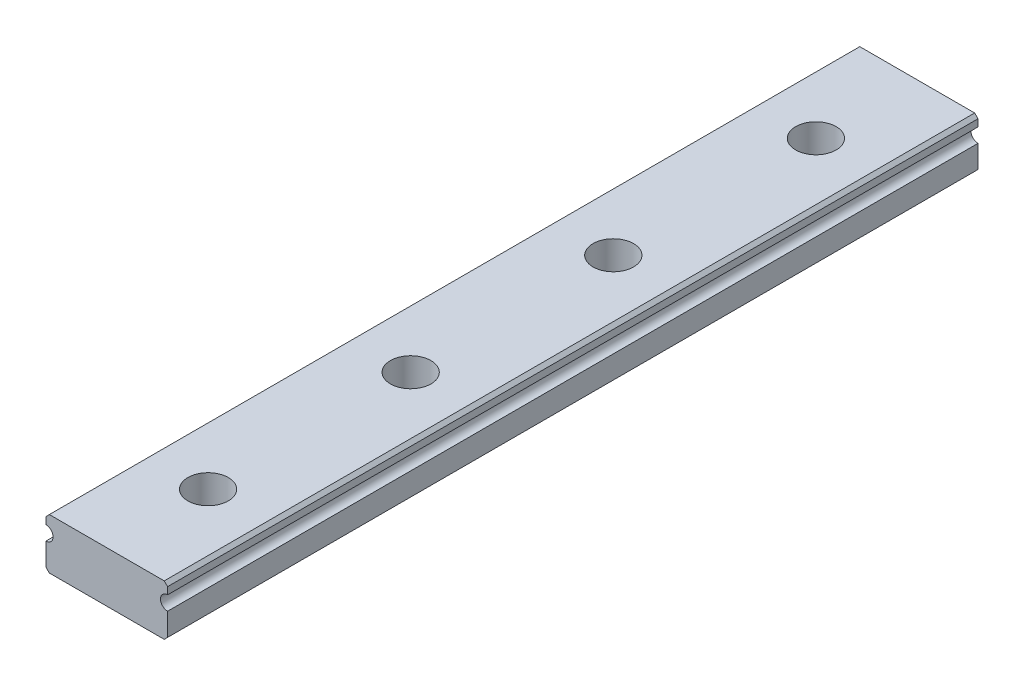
ISO-10303-21;
HEADER;
FILE_DESCRIPTION(('STEP AP214'),'2;1');
FILE_NAME('part.step','',(''),(''),'','','');
FILE_SCHEMA(('AUTOMOTIVE_DESIGN { 1 0 10303 214 1 1 1 1 }'));
ENDSEC;
DATA;
#1=APPLICATION_CONTEXT('core data for automotive mechanical design processes');
#2=APPLICATION_PROTOCOL_DEFINITION('international standard','automotive_design',2000,#1);
#3=PRODUCT_CONTEXT('',#1,'mechanical');
#4=PRODUCT('Part','Part','',(#3));
#5=PRODUCT_RELATED_PRODUCT_CATEGORY('part','',(#4));
#6=PRODUCT_DEFINITION_FORMATION('','',#4);
#7=PRODUCT_DEFINITION_CONTEXT('part definition',#1,'design');
#8=PRODUCT_DEFINITION('design','',#6,#7);
#9=PRODUCT_DEFINITION_SHAPE('','',#8);
#10=(LENGTH_UNIT() NAMED_UNIT(*) SI_UNIT(.MILLI.,.METRE.));
#11=(NAMED_UNIT(*) PLANE_ANGLE_UNIT() SI_UNIT($,.RADIAN.));
#12=(NAMED_UNIT(*) SI_UNIT($,.STERADIAN.) SOLID_ANGLE_UNIT());
#13=UNCERTAINTY_MEASURE_WITH_UNIT(LENGTH_MEASURE(1.E-05),#10,'distance_accuracy_value','');
#14=(GEOMETRIC_REPRESENTATION_CONTEXT(3) GLOBAL_UNCERTAINTY_ASSIGNED_CONTEXT((#13)) GLOBAL_UNIT_ASSIGNED_CONTEXT((#10,
#11,#12)) REPRESENTATION_CONTEXT('',''));
#15=CARTESIAN_POINT('',(0.,0.,0.));
#16=DIRECTION('',(0.,0.,1.));
#17=DIRECTION('',(1.,0.,0.));
#18=AXIS2_PLACEMENT_3D('',#15,#16,#17);
#19=CARTESIAN_POINT('',(9.,5.956,80.));
#20=DIRECTION('',(-1.,0.,0.));
#21=DIRECTION('',(0.,0.,1.));
#22=AXIS2_PLACEMENT_3D('',#19,#20,#21);
#23=PLANE('',#22);
#24=DIRECTION('',(0.,1.,0.));
#25=VECTOR('',#24,1.);
#26=CARTESIAN_POINT('',(9.,5.956,-5.));
#27=LINE('',#26,#25);
#28=CARTESIAN_POINT('',(9.,7.00502525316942,-5.));
#29=VERTEX_POINT('',#28);
#30=CARTESIAN_POINT('',(9.,5.956,-5.));
#31=VERTEX_POINT('',#30);
#32=EDGE_CURVE('E207',#29,#31,#27,.F.);
#33=ORIENTED_EDGE('',*,*,#32,.F.);
#34=DIRECTION('',(0.,0.,1.));
#35=VECTOR('',#34,1.);
#36=CARTESIAN_POINT('',(9.,7.00502525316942,80.));
#37=LINE('',#36,#35);
#38=CARTESIAN_POINT('',(9.,7.00502525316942,115.));
#39=VERTEX_POINT('',#38);
#40=EDGE_CURVE('E232',#29,#39,#37,.T.);
#41=ORIENTED_EDGE('',*,*,#40,.T.);
#42=DIRECTION('',(0.,1.,0.));
#43=VECTOR('',#42,1.);
#44=CARTESIAN_POINT('',(9.,5.956,115.));
#45=LINE('',#44,#43);
#46=CARTESIAN_POINT('',(9.,5.956,115.));
#47=VERTEX_POINT('',#46);
#48=EDGE_CURVE('E210',#47,#39,#45,.T.);
#49=ORIENTED_EDGE('',*,*,#48,.F.);
#50=DIRECTION('',(0.,0.,-1.));
#51=VECTOR('',#50,1.);
#52=CARTESIAN_POINT('',(9.,5.956,80.));
#53=LINE('',#52,#51);
#54=EDGE_CURVE('E163',#47,#31,#53,.T.);
#55=ORIENTED_EDGE('',*,*,#54,.T.);
#56=EDGE_LOOP('',(#33,#41,#49,#55));
#57=FACE_BOUND('',#56,.T.);
#58=ADVANCED_FACE('F17',(#57),#23,.F.);
#59=CARTESIAN_POINT('',(-9.,7.00502525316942,80.));
#60=DIRECTION('',(1.,0.,0.));
#61=DIRECTION('',(0.,0.,-1.));
#62=AXIS2_PLACEMENT_3D('',#59,#60,#61);
#63=PLANE('',#62);
#64=DIRECTION('',(0.,1.,0.));
#65=VECTOR('',#64,1.);
#66=CARTESIAN_POINT('',(-9.,7.00502525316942,-5.));
#67=LINE('',#66,#65);
#68=CARTESIAN_POINT('',(-9.,5.956,-5.));
#69=VERTEX_POINT('',#68);
#70=CARTESIAN_POINT('',(-9.,7.00502525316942,-5.));
#71=VERTEX_POINT('',#70);
#72=EDGE_CURVE('E201',#69,#71,#67,.T.);
#73=ORIENTED_EDGE('',*,*,#72,.F.);
#74=DIRECTION('',(0.,0.,-1.));
#75=VECTOR('',#74,1.);
#76=CARTESIAN_POINT('',(-9.,5.956,80.));
#77=LINE('',#76,#75);
#78=CARTESIAN_POINT('',(-9.,5.956,115.));
#79=VERTEX_POINT('',#78);
#80=EDGE_CURVE('E149',#69,#79,#77,.F.);
#81=ORIENTED_EDGE('',*,*,#80,.T.);
#82=DIRECTION('',(0.,1.,0.));
#83=VECTOR('',#82,1.);
#84=CARTESIAN_POINT('',(-9.,7.00502525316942,115.));
#85=LINE('',#84,#83);
#86=CARTESIAN_POINT('',(-9.,7.00502525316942,115.));
#87=VERTEX_POINT('',#86);
#88=EDGE_CURVE('E104',#87,#79,#85,.F.);
#89=ORIENTED_EDGE('',*,*,#88,.F.);
#90=DIRECTION('',(0.,0.,1.));
#91=VECTOR('',#90,1.);
#92=CARTESIAN_POINT('',(-9.,7.00502525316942,80.));
#93=LINE('',#92,#91);
#94=EDGE_CURVE('E222',#87,#71,#93,.F.);
#95=ORIENTED_EDGE('',*,*,#94,.T.);
#96=EDGE_LOOP('',(#73,#81,#89,#95));
#97=FACE_BOUND('',#96,.T.);
#98=ADVANCED_FACE('F291',(#97),#63,.F.);
#99=CARTESIAN_POINT('',(0.,0.,40.));
#100=DIRECTION('',(0.,1.,0.));
#101=DIRECTION('',(0.,0.,1.));
#102=AXIS2_PLACEMENT_3D('',#99,#100,#101);
#103=CYLINDRICAL_SURFACE('',#102,3.);
#104=CARTESIAN_POINT('',(0.,3.,40.));
#105=DIRECTION('',(0.,1.,0.));
#106=DIRECTION('',(0.,0.,1.));
#107=AXIS2_PLACEMENT_3D('',#104,#105,#106);
#108=CIRCLE('',#107,3.);
#109=CARTESIAN_POINT('',(0.,3.,43.));
#110=VERTEX_POINT('',#109);
#111=EDGE_CURVE('E20',#110,#110,#108,.T.);
#112=ORIENTED_EDGE('',*,*,#111,.F.);
#113=EDGE_LOOP('',(#112));
#114=FACE_BOUND('',#113,.T.);
#115=CARTESIAN_POINT('',(0.,7.5,40.));
#116=DIRECTION('',(0.,1.,0.));
#117=DIRECTION('',(0.,0.,1.));
#118=AXIS2_PLACEMENT_3D('',#115,#116,#117);
#119=CIRCLE('',#118,3.);
#120=CARTESIAN_POINT('',(0.,7.5,43.));
#121=VERTEX_POINT('',#120);
#122=EDGE_CURVE('E150',#121,#121,#119,.T.);
#123=ORIENTED_EDGE('',*,*,#122,.T.);
#124=EDGE_LOOP('',(#123));
#125=FACE_BOUND('',#124,.T.);
#126=ADVANCED_FACE('F287',(#114,#125),#103,.F.);
#127=CARTESIAN_POINT('',(0.,0.,10.));
#128=DIRECTION('',(0.,1.,0.));
#129=DIRECTION('',(0.,0.,1.));
#130=AXIS2_PLACEMENT_3D('',#127,#128,#129);
#131=CYLINDRICAL_SURFACE('',#130,3.);
#132=CARTESIAN_POINT('',(0.,3.,10.));
#133=DIRECTION('',(0.,1.,0.));
#134=DIRECTION('',(0.,0.,1.));
#135=AXIS2_PLACEMENT_3D('',#132,#133,#134);
#136=CIRCLE('',#135,3.);
#137=CARTESIAN_POINT('',(0.,3.,13.));
#138=VERTEX_POINT('',#137);
#139=EDGE_CURVE('E179',#138,#138,#136,.T.);
#140=ORIENTED_EDGE('',*,*,#139,.F.);
#141=EDGE_LOOP('',(#140));
#142=FACE_BOUND('',#141,.T.);
#143=CARTESIAN_POINT('',(0.,7.5,10.));
#144=DIRECTION('',(0.,1.,0.));
#145=DIRECTION('',(0.,0.,1.));
#146=AXIS2_PLACEMENT_3D('',#143,#144,#145);
#147=CIRCLE('',#146,3.);
#148=CARTESIAN_POINT('',(0.,7.5,13.));
#149=VERTEX_POINT('',#148);
#150=EDGE_CURVE('E148',#149,#149,#147,.T.);
#151=ORIENTED_EDGE('',*,*,#150,.T.);
#152=EDGE_LOOP('',(#151));
#153=FACE_BOUND('',#152,.T.);
#154=ADVANCED_FACE('F290',(#142,#153),#131,.F.);
#155=CARTESIAN_POINT('',(-8.50502525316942,7.5,80.));
#156=DIRECTION('',(0.707106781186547,-0.707106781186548,0.));
#157=DIRECTION('',(0.707106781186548,0.707106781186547,0.));
#158=AXIS2_PLACEMENT_3D('',#155,#156,#157);
#159=PLANE('',#158);
#160=DIRECTION('',(0.707106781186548,0.707106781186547,0.));
#161=VECTOR('',#160,1.);
#162=CARTESIAN_POINT('',(-8.50502525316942,7.5,-5.));
#163=LINE('',#162,#161);
#164=CARTESIAN_POINT('',(-8.50502525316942,7.5,-5.));
#165=VERTEX_POINT('',#164);
#166=EDGE_CURVE('E219',#71,#165,#163,.T.);
#167=ORIENTED_EDGE('',*,*,#166,.F.);
#168=ORIENTED_EDGE('',*,*,#94,.F.);
#169=DIRECTION('',(0.707106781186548,0.707106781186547,0.));
#170=VECTOR('',#169,1.);
#171=CARTESIAN_POINT('',(-8.50502525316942,7.5,115.));
#172=LINE('',#171,#170);
#173=CARTESIAN_POINT('',(-8.50502525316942,7.5,115.));
#174=VERTEX_POINT('',#173);
#175=EDGE_CURVE('E203',#174,#87,#172,.F.);
#176=ORIENTED_EDGE('',*,*,#175,.F.);
#177=DIRECTION('',(0.,0.,-1.));
#178=VECTOR('',#177,1.);
#179=CARTESIAN_POINT('',(-8.50502525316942,7.5,80.));
#180=LINE('',#179,#178);
#181=EDGE_CURVE('E145',#174,#165,#180,.T.);
#182=ORIENTED_EDGE('',*,*,#181,.T.);
#183=EDGE_LOOP('',(#167,#168,#176,#182));
#184=FACE_BOUND('',#183,.T.);
#185=ADVANCED_FACE('F372',(#184),#159,.F.);
#186=CARTESIAN_POINT('',(9.,7.00502525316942,80.));
#187=DIRECTION('',(-0.707106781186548,-0.707106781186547,0.));
#188=DIRECTION('',(0.707106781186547,-0.707106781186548,0.));
#189=AXIS2_PLACEMENT_3D('',#186,#187,#188);
#190=PLANE('',#189);
#191=DIRECTION('',(0.707106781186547,-0.707106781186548,0.));
#192=VECTOR('',#191,1.);
#193=CARTESIAN_POINT('',(9.,7.00502525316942,-5.));
#194=LINE('',#193,#192);
#195=CARTESIAN_POINT('',(8.50502525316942,7.5,-5.));
#196=VERTEX_POINT('',#195);
#197=EDGE_CURVE('E235',#196,#29,#194,.T.);
#198=ORIENTED_EDGE('',*,*,#197,.F.);
#199=DIRECTION('',(0.,0.,-1.));
#200=VECTOR('',#199,1.);
#201=CARTESIAN_POINT('',(8.50502525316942,7.5,80.));
#202=LINE('',#201,#200);
#203=CARTESIAN_POINT('',(8.50502525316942,7.5,115.));
#204=VERTEX_POINT('',#203);
#205=EDGE_CURVE('E141',#196,#204,#202,.F.);
#206=ORIENTED_EDGE('',*,*,#205,.T.);
#207=DIRECTION('',(0.707106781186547,-0.707106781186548,0.));
#208=VECTOR('',#207,1.);
#209=CARTESIAN_POINT('',(9.,7.00502525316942,115.));
#210=LINE('',#209,#208);
#211=EDGE_CURVE('E221',#39,#204,#210,.F.);
#212=ORIENTED_EDGE('',*,*,#211,.F.);
#213=ORIENTED_EDGE('',*,*,#40,.F.);
#214=EDGE_LOOP('',(#198,#206,#212,#213));
#215=FACE_BOUND('',#214,.T.);
#216=ADVANCED_FACE('F363',(#215),#190,.F.);
#217=CARTESIAN_POINT('',(0.,0.,70.));
#218=DIRECTION('',(0.,1.,0.));
#219=DIRECTION('',(0.,0.,1.));
#220=AXIS2_PLACEMENT_3D('',#217,#218,#219);
#221=CYLINDRICAL_SURFACE('',#220,3.);
#222=CARTESIAN_POINT('',(0.,7.5,70.));
#223=DIRECTION('',(0.,1.,0.));
#224=DIRECTION('',(0.,0.,1.));
#225=AXIS2_PLACEMENT_3D('',#222,#223,#224);
#226=CIRCLE('',#225,3.);
#227=CARTESIAN_POINT('',(0.,7.5,73.));
#228=VERTEX_POINT('',#227);
#229=EDGE_CURVE('E144',#228,#228,#226,.T.);
#230=ORIENTED_EDGE('',*,*,#229,.T.);
#231=EDGE_LOOP('',(#230));
#232=FACE_BOUND('',#231,.T.);
#233=CARTESIAN_POINT('',(0.,3.,70.));
#234=DIRECTION('',(0.,1.,0.));
#235=DIRECTION('',(0.,0.,1.));
#236=AXIS2_PLACEMENT_3D('',#233,#234,#235);
#237=CIRCLE('',#236,3.);
#238=CARTESIAN_POINT('',(0.,3.,73.));
#239=VERTEX_POINT('',#238);
#240=EDGE_CURVE('E125',#239,#239,#237,.T.);
#241=ORIENTED_EDGE('',*,*,#240,.F.);
#242=EDGE_LOOP('',(#241));
#243=FACE_BOUND('',#242,.T.);
#244=ADVANCED_FACE('F360',(#232,#243),#221,.F.);
#245=CARTESIAN_POINT('',(0.,0.,100.));
#246=DIRECTION('',(0.,1.,0.));
#247=DIRECTION('',(0.,0.,1.));
#248=AXIS2_PLACEMENT_3D('',#245,#246,#247);
#249=CYLINDRICAL_SURFACE('',#248,3.);
#250=CARTESIAN_POINT('',(0.,7.5,100.));
#251=DIRECTION('',(0.,1.,0.));
#252=DIRECTION('',(0.,0.,1.));
#253=AXIS2_PLACEMENT_3D('',#250,#251,#252);
#254=CIRCLE('',#253,3.);
#255=CARTESIAN_POINT('',(0.,7.5,103.));
#256=VERTEX_POINT('',#255);
#257=EDGE_CURVE('E126',#256,#256,#254,.T.);
#258=ORIENTED_EDGE('',*,*,#257,.T.);
#259=EDGE_LOOP('',(#258));
#260=FACE_BOUND('',#259,.T.);
#261=CARTESIAN_POINT('',(0.,3.,100.));
#262=DIRECTION('',(0.,1.,0.));
#263=DIRECTION('',(0.,0.,1.));
#264=AXIS2_PLACEMENT_3D('',#261,#262,#263);
#265=CIRCLE('',#264,3.);
#266=CARTESIAN_POINT('',(0.,3.,103.));
#267=VERTEX_POINT('',#266);
#268=EDGE_CURVE('E267',#267,#267,#265,.T.);
#269=ORIENTED_EDGE('',*,*,#268,.F.);
#270=EDGE_LOOP('',(#269));
#271=FACE_BOUND('',#270,.T.);
#272=ADVANCED_FACE('F362',(#260,#271),#249,.F.);
#273=CARTESIAN_POINT('',(0.,3.,37.));
#274=DIRECTION('',(0.,1.,0.));
#275=DIRECTION('',(0.,0.,1.));
#276=AXIS2_PLACEMENT_3D('',#273,#274,#275);
#277=PLANE('',#276);
#278=CARTESIAN_POINT('',(0.,3.,40.));
#279=DIRECTION('',(0.,1.,0.));
#280=DIRECTION('',(0.,0.,1.));
#281=AXIS2_PLACEMENT_3D('',#278,#279,#280);
#282=CIRCLE('',#281,1.75);
#283=CARTESIAN_POINT('',(0.,3.,41.75));
#284=VERTEX_POINT('',#283);
#285=EDGE_CURVE('E264',#284,#284,#282,.F.);
#286=ORIENTED_EDGE('',*,*,#285,.T.);
#287=EDGE_LOOP('',(#286));
#288=FACE_BOUND('',#287,.T.);
#289=ORIENTED_EDGE('',*,*,#111,.T.);
#290=EDGE_LOOP('',(#289));
#291=FACE_BOUND('',#290,.T.);
#292=ADVANCED_FACE('F285',(#288,#291),#277,.T.);
#293=CARTESIAN_POINT('',(0.,3.,7.));
#294=DIRECTION('',(0.,1.,0.));
#295=DIRECTION('',(0.,0.,1.));
#296=AXIS2_PLACEMENT_3D('',#293,#294,#295);
#297=PLANE('',#296);
#298=CARTESIAN_POINT('',(0.,3.,10.));
#299=DIRECTION('',(0.,1.,0.));
#300=DIRECTION('',(0.,0.,1.));
#301=AXIS2_PLACEMENT_3D('',#298,#299,#300);
#302=CIRCLE('',#301,1.75);
#303=CARTESIAN_POINT('',(0.,3.,11.75));
#304=VERTEX_POINT('',#303);
#305=EDGE_CURVE('E116',#304,#304,#302,.F.);
#306=ORIENTED_EDGE('',*,*,#305,.T.);
#307=EDGE_LOOP('',(#306));
#308=FACE_BOUND('',#307,.T.);
#309=ORIENTED_EDGE('',*,*,#139,.T.);
#310=EDGE_LOOP('',(#309));
#311=FACE_BOUND('',#310,.T.);
#312=ADVANCED_FACE('F429',(#308,#311),#297,.T.);
#313=CARTESIAN_POINT('',(9.,4.906,80.));
#314=DIRECTION('',(0.,0.,-1.));
#315=DIRECTION('',(-1.,0.,0.));
#316=AXIS2_PLACEMENT_3D('',#313,#314,#315);
#317=CYLINDRICAL_SURFACE('',#316,1.05);
#318=CARTESIAN_POINT('',(9.,4.906,115.));
#319=DIRECTION('',(0.,0.,-1.));
#320=DIRECTION('',(-1.,0.,0.));
#321=AXIS2_PLACEMENT_3D('',#318,#319,#320);
#322=CIRCLE('',#321,1.05);
#323=CARTESIAN_POINT('',(9.,3.856,115.));
#324=VERTEX_POINT('',#323);
#325=EDGE_CURVE('E134',#324,#47,#322,.T.);
#326=ORIENTED_EDGE('',*,*,#325,.F.);
#327=DIRECTION('',(0.,0.,1.));
#328=VECTOR('',#327,1.);
#329=CARTESIAN_POINT('',(9.,3.856,80.));
#330=LINE('',#329,#328);
#331=CARTESIAN_POINT('',(9.,3.856,-5.));
#332=VERTEX_POINT('',#331);
#333=EDGE_CURVE('E151',#324,#332,#330,.F.);
#334=ORIENTED_EDGE('',*,*,#333,.T.);
#335=CARTESIAN_POINT('',(9.,4.906,-5.));
#336=DIRECTION('',(0.,0.,-1.));
#337=DIRECTION('',(-1.,0.,0.));
#338=AXIS2_PLACEMENT_3D('',#335,#336,#337);
#339=CIRCLE('',#338,1.05);
#340=EDGE_CURVE('E167',#31,#332,#339,.F.);
#341=ORIENTED_EDGE('',*,*,#340,.F.);
#342=ORIENTED_EDGE('',*,*,#54,.F.);
#343=EDGE_LOOP('',(#326,#334,#341,#342));
#344=FACE_BOUND('',#343,.T.);
#345=ADVANCED_FACE('F411',(#344),#317,.F.);
#346=CARTESIAN_POINT('',(9.,0.494974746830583,80.));
#347=DIRECTION('',(-1.,0.,0.));
#348=DIRECTION('',(0.,0.,1.));
#349=AXIS2_PLACEMENT_3D('',#346,#347,#348);
#350=PLANE('',#349);
#351=DIRECTION('',(0.,1.,0.));
#352=VECTOR('',#351,1.);
#353=CARTESIAN_POINT('',(9.,4.906,-5.));
#354=LINE('',#353,#352);
#355=CARTESIAN_POINT('',(9.,0.494974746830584,-5.00000000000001));
#356=VERTEX_POINT('',#355);
#357=EDGE_CURVE('E174',#332,#356,#354,.F.);
#358=ORIENTED_EDGE('',*,*,#357,.F.);
#359=ORIENTED_EDGE('',*,*,#333,.F.);
#360=DIRECTION('',(0.,1.,0.));
#361=VECTOR('',#360,1.);
#362=CARTESIAN_POINT('',(9.,4.906,115.));
#363=LINE('',#362,#361);
#364=CARTESIAN_POINT('',(9.,0.494974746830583,115.));
#365=VERTEX_POINT('',#364);
#366=EDGE_CURVE('E131',#365,#324,#363,.T.);
#367=ORIENTED_EDGE('',*,*,#366,.F.);
#368=DIRECTION('',(0.,0.,1.));
#369=VECTOR('',#368,1.);
#370=CARTESIAN_POINT('',(9.,0.494974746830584,80.));
#371=LINE('',#370,#369);
#372=EDGE_CURVE('E164',#365,#356,#371,.F.);
#373=ORIENTED_EDGE('',*,*,#372,.T.);
#374=EDGE_LOOP('',(#358,#359,#367,#373));
#375=FACE_BOUND('',#374,.T.);
#376=ADVANCED_FACE('F306',(#375),#350,.F.);
#377=CARTESIAN_POINT('',(-9.,4.906,80.));
#378=DIRECTION('',(0.,0.,-1.));
#379=DIRECTION('',(-1.,0.,0.));
#380=AXIS2_PLACEMENT_3D('',#377,#378,#379);
#381=CYLINDRICAL_SURFACE('',#380,1.05);
#382=CARTESIAN_POINT('',(-9.,4.906,-5.));
#383=DIRECTION('',(0.,0.,-1.));
#384=DIRECTION('',(-1.,0.,0.));
#385=AXIS2_PLACEMENT_3D('',#382,#383,#384);
#386=CIRCLE('',#385,1.05);
#387=CARTESIAN_POINT('',(-9.,3.856,-5.));
#388=VERTEX_POINT('',#387);
#389=EDGE_CURVE('E122',#388,#69,#386,.F.);
#390=ORIENTED_EDGE('',*,*,#389,.F.);
#391=DIRECTION('',(0.,0.,-1.));
#392=VECTOR('',#391,1.);
#393=CARTESIAN_POINT('',(-9.,3.856,80.));
#394=LINE('',#393,#392);
#395=CARTESIAN_POINT('',(-9.,3.856,115.));
#396=VERTEX_POINT('',#395);
#397=EDGE_CURVE('E119',#388,#396,#394,.F.);
#398=ORIENTED_EDGE('',*,*,#397,.T.);
#399=CARTESIAN_POINT('',(-9.,4.906,115.));
#400=DIRECTION('',(0.,0.,-1.));
#401=DIRECTION('',(-1.,0.,0.));
#402=AXIS2_PLACEMENT_3D('',#399,#400,#401);
#403=CIRCLE('',#402,1.05);
#404=EDGE_CURVE('E107',#79,#396,#403,.T.);
#405=ORIENTED_EDGE('',*,*,#404,.F.);
#406=ORIENTED_EDGE('',*,*,#80,.F.);
#407=EDGE_LOOP('',(#390,#398,#405,#406));
#408=FACE_BOUND('',#407,.T.);
#409=ADVANCED_FACE('F120',(#408),#381,.F.);
#410=CARTESIAN_POINT('',(8.50502525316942,7.5,80.));
#411=DIRECTION('',(0.,-1.,0.));
#412=DIRECTION('',(0.,0.,-1.));
#413=AXIS2_PLACEMENT_3D('',#410,#411,#412);
#414=PLANE('',#413);
#415=ORIENTED_EDGE('',*,*,#257,.F.);
#416=EDGE_LOOP('',(#415));
#417=FACE_BOUND('',#416,.T.);
#418=ORIENTED_EDGE('',*,*,#229,.F.);
#419=EDGE_LOOP('',(#418));
#420=FACE_BOUND('',#419,.T.);
#421=DIRECTION('',(-1.,0.,0.));
#422=VECTOR('',#421,1.);
#423=CARTESIAN_POINT('',(9.,7.5,-5.));
#424=LINE('',#423,#422);
#425=EDGE_CURVE('E198',#165,#196,#424,.F.);
#426=ORIENTED_EDGE('',*,*,#425,.F.);
#427=ORIENTED_EDGE('',*,*,#181,.F.);
#428=DIRECTION('',(1.,0.,0.));
#429=VECTOR('',#428,1.);
#430=CARTESIAN_POINT('',(-9.,7.5,115.));
#431=LINE('',#430,#429);
#432=EDGE_CURVE('E182',#204,#174,#431,.F.);
#433=ORIENTED_EDGE('',*,*,#432,.F.);
#434=ORIENTED_EDGE('',*,*,#205,.F.);
#435=EDGE_LOOP('',(#426,#427,#433,#434));
#436=FACE_BOUND('',#435,.T.);
#437=ORIENTED_EDGE('',*,*,#150,.F.);
#438=EDGE_LOOP('',(#437));
#439=FACE_BOUND('',#438,.T.);
#440=ORIENTED_EDGE('',*,*,#122,.F.);
#441=EDGE_LOOP('',(#440));
#442=FACE_BOUND('',#441,.T.);
#443=ADVANCED_FACE('F295',(#417,#420,#436,#439,#442),#414,.F.);
#444=CARTESIAN_POINT('',(-9.,3.856,80.));
#445=DIRECTION('',(1.,0.,0.));
#446=DIRECTION('',(0.,0.,-1.));
#447=AXIS2_PLACEMENT_3D('',#444,#445,#446);
#448=PLANE('',#447);
#449=DIRECTION('',(0.,1.,0.));
#450=VECTOR('',#449,1.);
#451=CARTESIAN_POINT('',(-9.,4.906,-5.));
#452=LINE('',#451,#450);
#453=CARTESIAN_POINT('',(-9.,0.494974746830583,-5.));
#454=VERTEX_POINT('',#453);
#455=EDGE_CURVE('E173',#454,#388,#452,.T.);
#456=ORIENTED_EDGE('',*,*,#455,.F.);
#457=DIRECTION('',(0.,0.,1.));
#458=VECTOR('',#457,1.);
#459=CARTESIAN_POINT('',(-9.,0.494974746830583,80.));
#460=LINE('',#459,#458);
#461=CARTESIAN_POINT('',(-9.00000000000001,0.494974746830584,115.));
#462=VERTEX_POINT('',#461);
#463=EDGE_CURVE('E130',#454,#462,#460,.T.);
#464=ORIENTED_EDGE('',*,*,#463,.T.);
#465=DIRECTION('',(0.,1.,0.));
#466=VECTOR('',#465,1.);
#467=CARTESIAN_POINT('',(-9.,4.906,115.));
#468=LINE('',#467,#466);
#469=EDGE_CURVE('E112',#396,#462,#468,.F.);
#470=ORIENTED_EDGE('',*,*,#469,.F.);
#471=ORIENTED_EDGE('',*,*,#397,.F.);
#472=EDGE_LOOP('',(#456,#464,#470,#471));
#473=FACE_BOUND('',#472,.T.);
#474=ADVANCED_FACE('F129',(#473),#448,.F.);
#475=CARTESIAN_POINT('',(0.,3.,67.));
#476=DIRECTION('',(0.,1.,0.));
#477=DIRECTION('',(0.,0.,1.));
#478=AXIS2_PLACEMENT_3D('',#475,#476,#477);
#479=PLANE('',#478);
#480=CARTESIAN_POINT('',(0.,3.,70.));
#481=DIRECTION('',(0.,1.,0.));
#482=DIRECTION('',(0.,0.,1.));
#483=AXIS2_PLACEMENT_3D('',#480,#481,#482);
#484=CIRCLE('',#483,1.75);
#485=CARTESIAN_POINT('',(0.,3.,71.75));
#486=VERTEX_POINT('',#485);
#487=EDGE_CURVE('E154',#486,#486,#484,.F.);
#488=ORIENTED_EDGE('',*,*,#487,.T.);
#489=EDGE_LOOP('',(#488));
#490=FACE_BOUND('',#489,.T.);
#491=ORIENTED_EDGE('',*,*,#240,.T.);
#492=EDGE_LOOP('',(#491));
#493=FACE_BOUND('',#492,.T.);
#494=ADVANCED_FACE('F304',(#490,#493),#479,.T.);
#495=CARTESIAN_POINT('',(0.,3.,97.));
#496=DIRECTION('',(0.,1.,0.));
#497=DIRECTION('',(0.,0.,1.));
#498=AXIS2_PLACEMENT_3D('',#495,#496,#497);
#499=PLANE('',#498);
#500=CARTESIAN_POINT('',(0.,3.,100.));
#501=DIRECTION('',(0.,1.,0.));
#502=DIRECTION('',(0.,0.,1.));
#503=AXIS2_PLACEMENT_3D('',#500,#501,#502);
#504=CIRCLE('',#503,1.75);
#505=CARTESIAN_POINT('',(0.,3.,101.75));
#506=VERTEX_POINT('',#505);
#507=EDGE_CURVE('E253',#506,#506,#504,.F.);
#508=ORIENTED_EDGE('',*,*,#507,.T.);
#509=EDGE_LOOP('',(#508));
#510=FACE_BOUND('',#509,.T.);
#511=ORIENTED_EDGE('',*,*,#268,.T.);
#512=EDGE_LOOP('',(#511));
#513=FACE_BOUND('',#512,.T.);
#514=ADVANCED_FACE('F347',(#510,#513),#499,.T.);
#515=CARTESIAN_POINT('',(0.,0.,40.));
#516=DIRECTION('',(0.,1.,0.));
#517=DIRECTION('',(0.,0.,1.));
#518=AXIS2_PLACEMENT_3D('',#515,#516,#517);
#519=CYLINDRICAL_SURFACE('',#518,1.75);
#520=CARTESIAN_POINT('',(0.,0.,40.));
#521=DIRECTION('',(0.,1.,0.));
#522=DIRECTION('',(0.,0.,1.));
#523=AXIS2_PLACEMENT_3D('',#520,#521,#522);
#524=CIRCLE('',#523,1.75);
#525=CARTESIAN_POINT('',(0.,0.,41.75));
#526=VERTEX_POINT('',#525);
#527=EDGE_CURVE('E250',#526,#526,#524,.F.);
#528=ORIENTED_EDGE('',*,*,#527,.T.);
#529=EDGE_LOOP('',(#528));
#530=FACE_BOUND('',#529,.T.);
#531=ORIENTED_EDGE('',*,*,#285,.F.);
#532=EDGE_LOOP('',(#531));
#533=FACE_BOUND('',#532,.T.);
#534=ADVANCED_FACE('F343',(#530,#533),#519,.F.);
#535=CARTESIAN_POINT('',(0.,0.,10.));
#536=DIRECTION('',(0.,1.,0.));
#537=DIRECTION('',(0.,0.,1.));
#538=AXIS2_PLACEMENT_3D('',#535,#536,#537);
#539=CYLINDRICAL_SURFACE('',#538,1.75);
#540=CARTESIAN_POINT('',(0.,0.,10.));
#541=DIRECTION('',(0.,1.,0.));
#542=DIRECTION('',(0.,0.,1.));
#543=AXIS2_PLACEMENT_3D('',#540,#541,#542);
#544=CIRCLE('',#543,1.75);
#545=CARTESIAN_POINT('',(0.,0.,11.75));
#546=VERTEX_POINT('',#545);
#547=EDGE_CURVE('E194',#546,#546,#544,.F.);
#548=ORIENTED_EDGE('',*,*,#547,.T.);
#549=EDGE_LOOP('',(#548));
#550=FACE_BOUND('',#549,.T.);
#551=ORIENTED_EDGE('',*,*,#305,.F.);
#552=EDGE_LOOP('',(#551));
#553=FACE_BOUND('',#552,.T.);
#554=ADVANCED_FACE('F340',(#550,#553),#539,.F.);
#555=CARTESIAN_POINT('',(-9.,4.906,115.));
#556=DIRECTION('',(0.,0.,1.));
#557=DIRECTION('',(1.,0.,0.));
#558=AXIS2_PLACEMENT_3D('',#555,#556,#557);
#559=PLANE('',#558);
#560=ORIENTED_EDGE('',*,*,#175,.T.);
#561=ORIENTED_EDGE('',*,*,#88,.T.);
#562=ORIENTED_EDGE('',*,*,#404,.T.);
#563=ORIENTED_EDGE('',*,*,#469,.T.);
#564=DIRECTION('',(-0.707106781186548,0.707106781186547,0.));
#565=VECTOR('',#564,1.);
#566=CARTESIAN_POINT('',(-9.,0.494974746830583,115.));
#567=LINE('',#566,#565);
#568=CARTESIAN_POINT('',(-8.50502525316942,0.,115.));
#569=VERTEX_POINT('',#568);
#570=EDGE_CURVE('E158',#462,#569,#567,.F.);
#571=ORIENTED_EDGE('',*,*,#570,.T.);
#572=DIRECTION('',(1.,0.,0.));
#573=VECTOR('',#572,1.);
#574=CARTESIAN_POINT('',(-8.50502525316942,0.,115.));
#575=LINE('',#574,#573);
#576=CARTESIAN_POINT('',(8.50502525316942,0.,115.));
#577=VERTEX_POINT('',#576);
#578=EDGE_CURVE('E189',#569,#577,#575,.T.);
#579=ORIENTED_EDGE('',*,*,#578,.T.);
#580=DIRECTION('',(-0.707106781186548,-0.707106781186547,0.));
#581=VECTOR('',#580,1.);
#582=CARTESIAN_POINT('',(8.50502525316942,0.,115.));
#583=LINE('',#582,#581);
#584=EDGE_CURVE('E168',#577,#365,#583,.F.);
#585=ORIENTED_EDGE('',*,*,#584,.T.);
#586=ORIENTED_EDGE('',*,*,#366,.T.);
#587=ORIENTED_EDGE('',*,*,#325,.T.);
#588=ORIENTED_EDGE('',*,*,#48,.T.);
#589=ORIENTED_EDGE('',*,*,#211,.T.);
#590=ORIENTED_EDGE('',*,*,#432,.T.);
#591=EDGE_LOOP('',(#560,#561,#562,#563,#571,#579,#585,#586,#587,#588,#589,#590));
#592=FACE_BOUND('',#591,.T.);
#593=ADVANCED_FACE('F109',(#592),#559,.T.);
#594=CARTESIAN_POINT('',(8.50502525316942,0.,80.));
#595=DIRECTION('',(-0.707106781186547,0.707106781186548,0.));
#596=DIRECTION('',(-0.707106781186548,-0.707106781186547,0.));
#597=AXIS2_PLACEMENT_3D('',#594,#595,#596);
#598=PLANE('',#597);
#599=DIRECTION('',(-0.707106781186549,-0.707106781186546,0.));
#600=VECTOR('',#599,1.);
#601=CARTESIAN_POINT('',(9.,0.494974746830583,-5.));
#602=LINE('',#601,#600);
#603=CARTESIAN_POINT('',(8.50502525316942,0.,-5.00000000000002));
#604=VERTEX_POINT('',#603);
#605=EDGE_CURVE('E171',#356,#604,#602,.T.);
#606=ORIENTED_EDGE('',*,*,#605,.F.);
#607=ORIENTED_EDGE('',*,*,#372,.F.);
#608=ORIENTED_EDGE('',*,*,#584,.F.);
#609=DIRECTION('',(0.,0.,1.));
#610=VECTOR('',#609,1.);
#611=CARTESIAN_POINT('',(8.50502525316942,0.,80.));
#612=LINE('',#611,#610);
#613=EDGE_CURVE('E185',#577,#604,#612,.F.);
#614=ORIENTED_EDGE('',*,*,#613,.T.);
#615=EDGE_LOOP('',(#606,#607,#608,#614));
#616=FACE_BOUND('',#615,.T.);
#617=ADVANCED_FACE('F333',(#616),#598,.F.);
#618=CARTESIAN_POINT('',(9.,4.906,-5.));
#619=DIRECTION('',(0.,0.,-1.));
#620=DIRECTION('',(-1.,0.,0.));
#621=AXIS2_PLACEMENT_3D('',#618,#619,#620);
#622=PLANE('',#621);
#623=ORIENTED_EDGE('',*,*,#197,.T.);
#624=ORIENTED_EDGE('',*,*,#32,.T.);
#625=ORIENTED_EDGE('',*,*,#340,.T.);
#626=ORIENTED_EDGE('',*,*,#357,.T.);
#627=ORIENTED_EDGE('',*,*,#605,.T.);
#628=DIRECTION('',(1.,0.,0.));
#629=VECTOR('',#628,1.);
#630=CARTESIAN_POINT('',(-8.50502525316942,0.,-5.));
#631=LINE('',#630,#629);
#632=CARTESIAN_POINT('',(-8.50502525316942,0.,-5.00000000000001));
#633=VERTEX_POINT('',#632);
#634=EDGE_CURVE('E188',#604,#633,#631,.F.);
#635=ORIENTED_EDGE('',*,*,#634,.T.);
#636=DIRECTION('',(-0.707106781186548,0.707106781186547,0.));
#637=VECTOR('',#636,1.);
#638=CARTESIAN_POINT('',(-9.,0.494974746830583,-5.00000000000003));
#639=LINE('',#638,#637);
#640=EDGE_CURVE('E35',#633,#454,#639,.T.);
#641=ORIENTED_EDGE('',*,*,#640,.T.);
#642=ORIENTED_EDGE('',*,*,#455,.T.);
#643=ORIENTED_EDGE('',*,*,#389,.T.);
#644=ORIENTED_EDGE('',*,*,#72,.T.);
#645=ORIENTED_EDGE('',*,*,#166,.T.);
#646=ORIENTED_EDGE('',*,*,#425,.T.);
#647=EDGE_LOOP('',(#623,#624,#625,#626,#627,#635,#641,#642,#643,#644,#645,#646));
#648=FACE_BOUND('',#647,.T.);
#649=ADVANCED_FACE('F330',(#648),#622,.T.);
#650=CARTESIAN_POINT('',(-9.,0.494974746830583,80.));
#651=DIRECTION('',(0.707106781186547,0.707106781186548,0.));
#652=DIRECTION('',(-0.707106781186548,0.707106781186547,0.));
#653=AXIS2_PLACEMENT_3D('',#650,#651,#652);
#654=PLANE('',#653);
#655=ORIENTED_EDGE('',*,*,#640,.F.);
#656=DIRECTION('',(0.,0.,1.));
#657=VECTOR('',#656,1.);
#658=CARTESIAN_POINT('',(-8.50502525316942,0.,80.));
#659=LINE('',#658,#657);
#660=EDGE_CURVE('E247',#633,#569,#659,.T.);
#661=ORIENTED_EDGE('',*,*,#660,.T.);
#662=ORIENTED_EDGE('',*,*,#570,.F.);
#663=ORIENTED_EDGE('',*,*,#463,.F.);
#664=EDGE_LOOP('',(#655,#661,#662,#663));
#665=FACE_BOUND('',#664,.T.);
#666=ADVANCED_FACE('F326',(#665),#654,.F.);
#667=CARTESIAN_POINT('',(0.,0.,70.));
#668=DIRECTION('',(0.,1.,0.));
#669=DIRECTION('',(0.,0.,1.));
#670=AXIS2_PLACEMENT_3D('',#667,#668,#669);
#671=CYLINDRICAL_SURFACE('',#670,1.75);
#672=CARTESIAN_POINT('',(0.,0.,70.));
#673=DIRECTION('',(0.,1.,0.));
#674=DIRECTION('',(0.,0.,1.));
#675=AXIS2_PLACEMENT_3D('',#672,#673,#674);
#676=CIRCLE('',#675,1.75);
#677=CARTESIAN_POINT('',(0.,0.,71.75));
#678=VERTEX_POINT('',#677);
#679=EDGE_CURVE('E26',#678,#678,#676,.F.);
#680=ORIENTED_EDGE('',*,*,#679,.T.);
#681=EDGE_LOOP('',(#680));
#682=FACE_BOUND('',#681,.T.);
#683=ORIENTED_EDGE('',*,*,#487,.F.);
#684=EDGE_LOOP('',(#683));
#685=FACE_BOUND('',#684,.T.);
#686=ADVANCED_FACE('F318',(#682,#685),#671,.F.);
#687=CARTESIAN_POINT('',(0.,0.,100.));
#688=DIRECTION('',(0.,1.,0.));
#689=DIRECTION('',(0.,0.,1.));
#690=AXIS2_PLACEMENT_3D('',#687,#688,#689);
#691=CYLINDRICAL_SURFACE('',#690,1.75);
#692=CARTESIAN_POINT('',(0.,0.,100.));
#693=DIRECTION('',(0.,1.,0.));
#694=DIRECTION('',(0.,0.,1.));
#695=AXIS2_PLACEMENT_3D('',#692,#693,#694);
#696=CIRCLE('',#695,1.75);
#697=CARTESIAN_POINT('',(0.,0.,101.75));
#698=VERTEX_POINT('',#697);
#699=EDGE_CURVE('E11',#698,#698,#696,.F.);
#700=ORIENTED_EDGE('',*,*,#699,.T.);
#701=EDGE_LOOP('',(#700));
#702=FACE_BOUND('',#701,.T.);
#703=ORIENTED_EDGE('',*,*,#507,.F.);
#704=EDGE_LOOP('',(#703));
#705=FACE_BOUND('',#704,.T.);
#706=ADVANCED_FACE('F312',(#702,#705),#691,.F.);
#707=CARTESIAN_POINT('',(-8.50502525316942,0.,80.));
#708=DIRECTION('',(0.,1.,0.));
#709=DIRECTION('',(0.,0.,1.));
#710=AXIS2_PLACEMENT_3D('',#707,#708,#709);
#711=PLANE('',#710);
#712=ORIENTED_EDGE('',*,*,#699,.F.);
#713=EDGE_LOOP('',(#712));
#714=FACE_BOUND('',#713,.T.);
#715=ORIENTED_EDGE('',*,*,#679,.F.);
#716=EDGE_LOOP('',(#715));
#717=FACE_BOUND('',#716,.T.);
#718=ORIENTED_EDGE('',*,*,#634,.F.);
#719=ORIENTED_EDGE('',*,*,#613,.F.);
#720=ORIENTED_EDGE('',*,*,#578,.F.);
#721=ORIENTED_EDGE('',*,*,#660,.F.);
#722=EDGE_LOOP('',(#718,#719,#720,#721));
#723=FACE_BOUND('',#722,.T.);
#724=ORIENTED_EDGE('',*,*,#547,.F.);
#725=EDGE_LOOP('',(#724));
#726=FACE_BOUND('',#725,.T.);
#727=ORIENTED_EDGE('',*,*,#527,.F.);
#728=EDGE_LOOP('',(#727));
#729=FACE_BOUND('',#728,.T.);
#730=ADVANCED_FACE('F310',(#714,#717,#723,#726,#729),#711,.F.);
#731=CLOSED_SHELL('',(#58,#98,#126,#154,#185,#216,#244,#272,#292,#312,#345,#376,#409,#443,#474,
#494,#514,#534,#554,#593,#617,#649,#666,#686,#706,#730));
#732=MANIFOLD_SOLID_BREP('B1',#731);
#733=ADVANCED_BREP_SHAPE_REPRESENTATION('',(#18,#732),#14);
#734=SHAPE_DEFINITION_REPRESENTATION(#9,#733);
ENDSEC;
END-ISO-10303-21;
